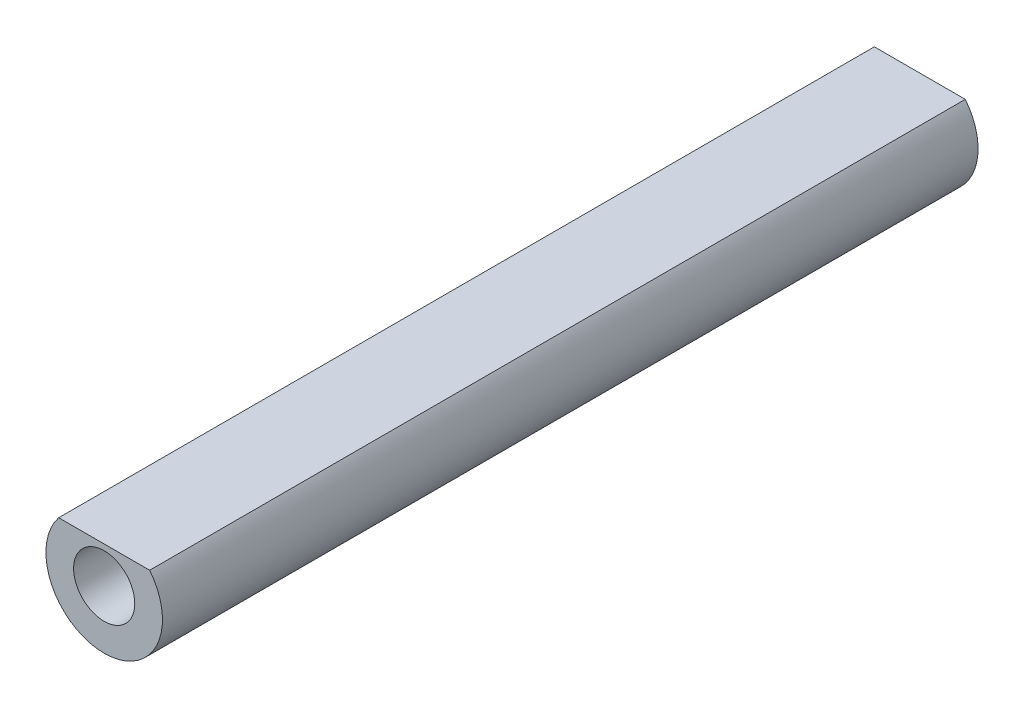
from build123d import *

# Parameters (mm, degrees)
ESQUISSE1_R             = 4
EXTRUSION1_DEPTH        = 28
TROU_TARAUD_M51_D       = 4.2
TROU_TARAUD_M51_DEPTH   = 14.4
TROU_TARAUD_M51_TIP     = 1.2618073
ESQUISSE4_W             = 9.8271431
ESQUISSE4_H             = 2.273100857
ENL_V_MAT_EXTRU_1_DEPTH = 29.565713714


with BuildPart() as part:
    # Esquisse1 → Extrusion1 (new body)
    with BuildSketch(Plane.XY):
        Circle(ESQUISSE1_R)
    extrude(amount=EXTRUSION1_DEPTH)

    # Trou taraud_ M51
    with Locations(Plane.XY.offset(28)):
        with Locations((0, 0)):
            Hole(TROU_TARAUD_M51_D / 2, depth=TROU_TARAUD_M51_DEPTH)
            with Locations((0, 0, -(TROU_TARAUD_M51_DEPTH + TROU_TARAUD_M51_TIP / 2))):  # 118° drill point
                Cone(0, TROU_TARAUD_M51_D / 2, TROU_TARAUD_M51_TIP, mode=Mode.SUBTRACT)

    # Esquisse4 → Enl_v. mat.-Extru.1 (cut, through all)
    with BuildSketch(Plane.XY):
        with Locations((-0.252566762, 3.636550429)):
            Rectangle(ESQUISSE4_W, ESQUISSE4_H)
    extrude(amount=ENL_V_MAT_EXTRU_1_DEPTH, mode=Mode.SUBTRACT)

    # Sym_trie1: part across plane


with BuildPart() as part_1:
    add(part.part)
    add(part.part.mirror(Plane.XY))


solid = part_1.part
